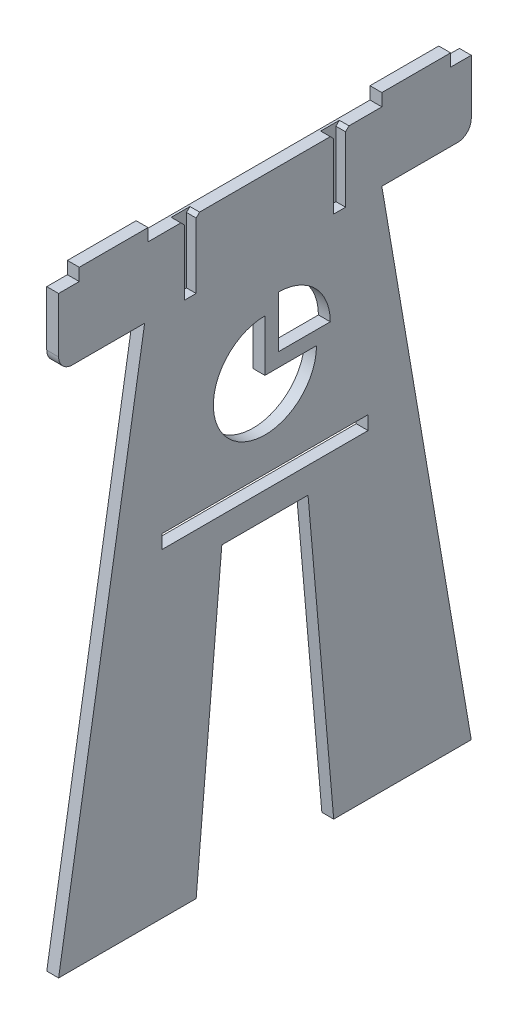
ISO-10303-21;
HEADER;
FILE_DESCRIPTION(('STEP AP214'),'2;1');
FILE_NAME('part.step','',(''),(''),'','','');
FILE_SCHEMA(('AUTOMOTIVE_DESIGN { 1 0 10303 214 1 1 1 1 }'));
ENDSEC;
DATA;
#1=APPLICATION_CONTEXT('core data for automotive mechanical design processes');
#2=APPLICATION_PROTOCOL_DEFINITION('international standard','automotive_design',2000,#1);
#3=PRODUCT_CONTEXT('',#1,'mechanical');
#4=PRODUCT('Part','Part','',(#3));
#5=PRODUCT_RELATED_PRODUCT_CATEGORY('part','',(#4));
#6=PRODUCT_DEFINITION_FORMATION('','',#4);
#7=PRODUCT_DEFINITION_CONTEXT('part definition',#1,'design');
#8=PRODUCT_DEFINITION('design','',#6,#7);
#9=PRODUCT_DEFINITION_SHAPE('','',#8);
#10=(LENGTH_UNIT() NAMED_UNIT(*) SI_UNIT(.MILLI.,.METRE.));
#11=(NAMED_UNIT(*) PLANE_ANGLE_UNIT() SI_UNIT($,.RADIAN.));
#12=(NAMED_UNIT(*) SI_UNIT($,.STERADIAN.) SOLID_ANGLE_UNIT());
#13=UNCERTAINTY_MEASURE_WITH_UNIT(LENGTH_MEASURE(1.E-05),#10,'distance_accuracy_value','');
#14=(GEOMETRIC_REPRESENTATION_CONTEXT(3) GLOBAL_UNCERTAINTY_ASSIGNED_CONTEXT((#13)) GLOBAL_UNIT_ASSIGNED_CONTEXT((#10,
#11,#12)) REPRESENTATION_CONTEXT('',''));
#15=CARTESIAN_POINT('',(0.,0.,0.));
#16=DIRECTION('',(0.,0.,1.));
#17=DIRECTION('',(1.,0.,0.));
#18=AXIS2_PLACEMENT_3D('',#15,#16,#17);
#19=CARTESIAN_POINT('',(17.25,-100.,80.3703703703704));
#20=DIRECTION('',(0.,0.,-1.));
#21=DIRECTION('',(-1.,0.,0.));
#22=AXIS2_PLACEMENT_3D('',#19,#20,#21);
#23=PLANE('',#22);
#24=DIRECTION('',(0.,-1.,0.));
#25=VECTOR('',#24,1.);
#26=CARTESIAN_POINT('',(0.,-100.,80.3703703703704));
#27=LINE('',#26,#25);
#28=CARTESIAN_POINT('',(0.,0.,80.3703703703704));
#29=VERTEX_POINT('',#28);
#30=CARTESIAN_POINT('',(0.,-80.,80.3703703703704));
#31=VERTEX_POINT('',#30);
#32=EDGE_CURVE('E440',#29,#31,#27,.T.);
#33=ORIENTED_EDGE('',*,*,#32,.T.);
#34=DIRECTION('',(-1.,0.,0.));
#35=VECTOR('',#34,1.);
#36=CARTESIAN_POINT('',(17.25,-80.,80.3703703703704));
#37=LINE('',#36,#35);
#38=CARTESIAN_POINT('',(17.25,-80.,80.3703703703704));
#39=VERTEX_POINT('',#38);
#40=EDGE_CURVE('E599',#31,#39,#37,.F.);
#41=ORIENTED_EDGE('',*,*,#40,.T.);
#42=DIRECTION('',(0.,-1.,0.));
#43=VECTOR('',#42,1.);
#44=CARTESIAN_POINT('',(17.25,-100.,80.3703703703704));
#45=LINE('',#44,#43);
#46=CARTESIAN_POINT('',(17.25,0.,80.3703703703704));
#47=VERTEX_POINT('',#46);
#48=EDGE_CURVE('E443',#47,#39,#45,.T.);
#49=ORIENTED_EDGE('',*,*,#48,.F.);
#50=DIRECTION('',(-1.,0.,0.));
#51=VECTOR('',#50,1.);
#52=CARTESIAN_POINT('',(17.25,0.,80.3703703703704));
#53=LINE('',#52,#51);
#54=EDGE_CURVE('E489',#47,#29,#53,.T.);
#55=ORIENTED_EDGE('',*,*,#54,.T.);
#56=EDGE_LOOP('',(#33,#41,#49,#55));
#57=FACE_BOUND('',#56,.T.);
#58=ADVANCED_FACE('F33',(#57),#23,.F.);
#59=CARTESIAN_POINT('',(17.25,-100.,80.3703703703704));
#60=DIRECTION('',(0.,1.,0.));
#61=DIRECTION('',(0.,0.,1.));
#62=AXIS2_PLACEMENT_3D('',#59,#60,#61);
#63=PLANE('',#62);
#64=DIRECTION('',(0.,0.,-1.));
#65=VECTOR('',#64,1.);
#66=CARTESIAN_POINT('',(17.25,-100.,80.3703703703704));
#67=LINE('',#66,#65);
#68=CARTESIAN_POINT('',(17.25,-100.,60.3703703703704));
#69=VERTEX_POINT('',#68);
#70=CARTESIAN_POINT('',(17.25,-100.,-44.7053872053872));
#71=VERTEX_POINT('',#70);
#72=EDGE_CURVE('E446',#69,#71,#67,.T.);
#73=ORIENTED_EDGE('',*,*,#72,.F.);
#74=DIRECTION('',(-1.,0.,0.));
#75=VECTOR('',#74,1.);
#76=CARTESIAN_POINT('',(17.25,-100.,60.3703703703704));
#77=LINE('',#76,#75);
#78=CARTESIAN_POINT('',(0.,-100.,60.3703703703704));
#79=VERTEX_POINT('',#78);
#80=EDGE_CURVE('E596',#69,#79,#77,.T.);
#81=ORIENTED_EDGE('',*,*,#80,.T.);
#82=DIRECTION('',(0.,0.,-1.));
#83=VECTOR('',#82,1.);
#84=CARTESIAN_POINT('',(0.,-100.,80.3703703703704));
#85=LINE('',#84,#83);
#86=CARTESIAN_POINT('',(0.,-100.,-44.7053872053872));
#87=VERTEX_POINT('',#86);
#88=EDGE_CURVE('E492',#79,#87,#85,.T.);
#89=ORIENTED_EDGE('',*,*,#88,.T.);
#90=DIRECTION('',(-1.,0.,0.));
#91=VECTOR('',#90,1.);
#92=CARTESIAN_POINT('',(17.25,-100.,-44.7053872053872));
#93=LINE('',#92,#91);
#94=EDGE_CURVE('E580',#71,#87,#93,.T.);
#95=ORIENTED_EDGE('',*,*,#94,.F.);
#96=EDGE_LOOP('',(#73,#81,#89,#95));
#97=FACE_BOUND('',#96,.T.);
#98=ADVANCED_FACE('F689',(#97),#63,.F.);
#99=CARTESIAN_POINT('',(17.25,-100.,-44.7053872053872));
#100=DIRECTION('',(0.,-0.161973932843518,-0.986795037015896));
#101=DIRECTION('',(0.,0.986795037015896,-0.161973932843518));
#102=AXIS2_PLACEMENT_3D('',#99,#100,#101);
#103=PLANE('',#102);
#104=DIRECTION('',(0.,-0.986795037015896,0.161973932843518));
#105=VECTOR('',#104,1.);
#106=CARTESIAN_POINT('',(0.,-100.,-44.7053872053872));
#107=LINE('',#106,#105);
#108=CARTESIAN_POINT('',(0.,-862.,80.3703703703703));
#109=VERTEX_POINT('',#108);
#110=EDGE_CURVE('E494',#87,#109,#107,.T.);
#111=ORIENTED_EDGE('',*,*,#110,.T.);
#112=DIRECTION('',(-1.,0.,0.));
#113=VECTOR('',#112,1.);
#114=CARTESIAN_POINT('',(17.25,-862.,80.3703703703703));
#115=LINE('',#114,#113);
#116=CARTESIAN_POINT('',(17.25,-862.,80.3703703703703));
#117=VERTEX_POINT('',#116);
#118=EDGE_CURVE('E577',#117,#109,#115,.T.);
#119=ORIENTED_EDGE('',*,*,#118,.F.);
#120=DIRECTION('',(0.,-0.986795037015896,0.161973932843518));
#121=VECTOR('',#120,1.);
#122=CARTESIAN_POINT('',(17.25,-100.,-44.7053872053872));
#123=LINE('',#122,#121);
#124=EDGE_CURVE('E449',#71,#117,#123,.T.);
#125=ORIENTED_EDGE('',*,*,#124,.F.);
#126=ORIENTED_EDGE('',*,*,#94,.T.);
#127=EDGE_LOOP('',(#111,#119,#125,#126));
#128=FACE_BOUND('',#127,.T.);
#129=ADVANCED_FACE('F698',(#128),#103,.F.);
#130=CARTESIAN_POINT('',(17.25,-862.,80.3703703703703));
#131=DIRECTION('',(0.,1.,0.));
#132=DIRECTION('',(0.,0.,1.));
#133=AXIS2_PLACEMENT_3D('',#130,#131,#132);
#134=PLANE('',#133);
#135=DIRECTION('',(0.,0.,-1.));
#136=VECTOR('',#135,1.);
#137=CARTESIAN_POINT('',(0.,-862.,80.3703703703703));
#138=LINE('',#137,#136);
#139=CARTESIAN_POINT('',(0.,-862.,-119.62962962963));
#140=VERTEX_POINT('',#139);
#141=EDGE_CURVE('E496',#109,#140,#138,.T.);
#142=ORIENTED_EDGE('',*,*,#141,.T.);
#143=DIRECTION('',(-1.,0.,0.));
#144=VECTOR('',#143,1.);
#145=CARTESIAN_POINT('',(17.25,-862.,-119.62962962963));
#146=LINE('',#145,#144);
#147=CARTESIAN_POINT('',(17.25,-862.,-119.62962962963));
#148=VERTEX_POINT('',#147);
#149=EDGE_CURVE('E574',#148,#140,#146,.T.);
#150=ORIENTED_EDGE('',*,*,#149,.F.);
#151=DIRECTION('',(0.,0.,-1.));
#152=VECTOR('',#151,1.);
#153=CARTESIAN_POINT('',(17.25,-862.,80.3703703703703));
#154=LINE('',#153,#152);
#155=EDGE_CURVE('E451',#117,#148,#154,.T.);
#156=ORIENTED_EDGE('',*,*,#155,.F.);
#157=ORIENTED_EDGE('',*,*,#118,.T.);
#158=EDGE_LOOP('',(#142,#150,#156,#157));
#159=FACE_BOUND('',#158,.T.);
#160=ADVANCED_FACE('F702',(#159),#134,.F.);
#161=CARTESIAN_POINT('',(17.25,-862.,-119.62962962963));
#162=DIRECTION('',(0.,0.0871557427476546,0.996194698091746));
#163=DIRECTION('',(0.,-0.996194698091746,0.0871557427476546));
#164=AXIS2_PLACEMENT_3D('',#161,#162,#163);
#165=PLANE('',#164);
#166=DIRECTION('',(0.,0.996194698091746,-0.0871557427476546));
#167=VECTOR('',#166,1.);
#168=CARTESIAN_POINT('',(0.,-862.,-119.62962962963));
#169=LINE('',#168,#167);
#170=CARTESIAN_POINT('',(0.,-435.290727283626,-156.961853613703));
#171=VERTEX_POINT('',#170);
#172=EDGE_CURVE('E498',#140,#171,#169,.T.);
#173=ORIENTED_EDGE('',*,*,#172,.T.);
#174=DIRECTION('',(-1.,0.,0.));
#175=VECTOR('',#174,1.);
#176=CARTESIAN_POINT('',(17.25,-435.290727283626,-156.961853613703));
#177=LINE('',#176,#175);
#178=CARTESIAN_POINT('',(17.25,-435.290727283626,-156.961853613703));
#179=VERTEX_POINT('',#178);
#180=EDGE_CURVE('E571',#179,#171,#177,.T.);
#181=ORIENTED_EDGE('',*,*,#180,.F.);
#182=DIRECTION('',(0.,0.996194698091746,-0.0871557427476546));
#183=VECTOR('',#182,1.);
#184=CARTESIAN_POINT('',(17.25,-862.,-119.62962962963));
#185=LINE('',#184,#183);
#186=EDGE_CURVE('E453',#148,#179,#185,.T.);
#187=ORIENTED_EDGE('',*,*,#186,.F.);
#188=ORIENTED_EDGE('',*,*,#149,.T.);
#189=EDGE_LOOP('',(#173,#181,#187,#188));
#190=FACE_BOUND('',#189,.T.);
#191=ADVANCED_FACE('F709',(#190),#165,.F.);
#192=CARTESIAN_POINT('',(17.25,-435.290727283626,-156.961853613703));
#193=DIRECTION('',(0.,1.,0.));
#194=DIRECTION('',(0.,0.,1.));
#195=AXIS2_PLACEMENT_3D('',#192,#193,#194);
#196=PLANE('',#195);
#197=DIRECTION('',(0.,0.,-1.));
#198=VECTOR('',#197,1.);
#199=CARTESIAN_POINT('',(0.,-435.290727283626,-156.961853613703));
#200=LINE('',#199,#198);
#201=CARTESIAN_POINT('',(0.,-435.290727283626,-282.297405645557));
#202=VERTEX_POINT('',#201);
#203=EDGE_CURVE('E500',#171,#202,#200,.T.);
#204=ORIENTED_EDGE('',*,*,#203,.T.);
#205=DIRECTION('',(-1.,0.,0.));
#206=VECTOR('',#205,1.);
#207=CARTESIAN_POINT('',(17.25,-435.290727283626,-282.297405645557));
#208=LINE('',#207,#206);
#209=CARTESIAN_POINT('',(17.25,-435.290727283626,-282.297405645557));
#210=VERTEX_POINT('',#209);
#211=EDGE_CURVE('E568',#210,#202,#208,.T.);
#212=ORIENTED_EDGE('',*,*,#211,.F.);
#213=DIRECTION('',(0.,0.,-1.));
#214=VECTOR('',#213,1.);
#215=CARTESIAN_POINT('',(17.25,-435.290727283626,-156.961853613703));
#216=LINE('',#215,#214);
#217=EDGE_CURVE('E455',#179,#210,#216,.T.);
#218=ORIENTED_EDGE('',*,*,#217,.F.);
#219=ORIENTED_EDGE('',*,*,#180,.T.);
#220=EDGE_LOOP('',(#204,#212,#218,#219));
#221=FACE_BOUND('',#220,.T.);
#222=ADVANCED_FACE('F712',(#221),#196,.F.);
#223=CARTESIAN_POINT('',(17.25,-435.290727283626,-282.297405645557));
#224=DIRECTION('',(0.,0.0871557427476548,-0.996194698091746));
#225=DIRECTION('',(0.,0.996194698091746,0.0871557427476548));
#226=AXIS2_PLACEMENT_3D('',#223,#224,#225);
#227=PLANE('',#226);
#228=DIRECTION('',(0.,-0.996194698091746,-0.0871557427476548));
#229=VECTOR('',#228,1.);
#230=CARTESIAN_POINT('',(0.,-435.290727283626,-282.297405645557));
#231=LINE('',#230,#229);
#232=CARTESIAN_POINT('',(0.,-862.,-319.62962962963));
#233=VERTEX_POINT('',#232);
#234=EDGE_CURVE('E502',#202,#233,#231,.T.);
#235=ORIENTED_EDGE('',*,*,#234,.T.);
#236=DIRECTION('',(-1.,0.,0.));
#237=VECTOR('',#236,1.);
#238=CARTESIAN_POINT('',(17.25,-862.,-319.62962962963));
#239=LINE('',#238,#237);
#240=CARTESIAN_POINT('',(17.25,-862.,-319.62962962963));
#241=VERTEX_POINT('',#240);
#242=EDGE_CURVE('E565',#241,#233,#239,.T.);
#243=ORIENTED_EDGE('',*,*,#242,.F.);
#244=DIRECTION('',(0.,-0.996194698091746,-0.0871557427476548));
#245=VECTOR('',#244,1.);
#246=CARTESIAN_POINT('',(17.25,-435.290727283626,-282.297405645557));
#247=LINE('',#246,#245);
#248=EDGE_CURVE('E457',#210,#241,#247,.T.);
#249=ORIENTED_EDGE('',*,*,#248,.F.);
#250=ORIENTED_EDGE('',*,*,#211,.T.);
#251=EDGE_LOOP('',(#235,#243,#249,#250));
#252=FACE_BOUND('',#251,.T.);
#253=ADVANCED_FACE('F717',(#252),#227,.F.);
#254=CARTESIAN_POINT('',(17.25,-862.,-319.62962962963));
#255=DIRECTION('',(0.,1.,0.));
#256=DIRECTION('',(0.,0.,1.));
#257=AXIS2_PLACEMENT_3D('',#254,#255,#256);
#258=PLANE('',#257);
#259=DIRECTION('',(0.,0.,-1.));
#260=VECTOR('',#259,1.);
#261=CARTESIAN_POINT('',(0.,-862.,-319.62962962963));
#262=LINE('',#261,#260);
#263=CARTESIAN_POINT('',(0.,-862.,-519.62962962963));
#264=VERTEX_POINT('',#263);
#265=EDGE_CURVE('E504',#233,#264,#262,.T.);
#266=ORIENTED_EDGE('',*,*,#265,.T.);
#267=DIRECTION('',(-1.,0.,0.));
#268=VECTOR('',#267,1.);
#269=CARTESIAN_POINT('',(17.25,-862.,-519.62962962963));
#270=LINE('',#269,#268);
#271=CARTESIAN_POINT('',(17.25,-862.,-519.62962962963));
#272=VERTEX_POINT('',#271);
#273=EDGE_CURVE('E562',#272,#264,#270,.T.);
#274=ORIENTED_EDGE('',*,*,#273,.F.);
#275=DIRECTION('',(0.,0.,-1.));
#276=VECTOR('',#275,1.);
#277=CARTESIAN_POINT('',(17.25,-862.,-319.62962962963));
#278=LINE('',#277,#276);
#279=EDGE_CURVE('E459',#241,#272,#278,.T.);
#280=ORIENTED_EDGE('',*,*,#279,.F.);
#281=ORIENTED_EDGE('',*,*,#242,.T.);
#282=EDGE_LOOP('',(#266,#274,#280,#281));
#283=FACE_BOUND('',#282,.T.);
#284=ADVANCED_FACE('F723',(#283),#258,.F.);
#285=CARTESIAN_POINT('',(17.25,-862.,-519.62962962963));
#286=DIRECTION('',(0.,-0.168173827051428,0.985757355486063));
#287=DIRECTION('',(0.,-0.985757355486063,-0.168173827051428));
#288=AXIS2_PLACEMENT_3D('',#285,#286,#287);
#289=PLANE('',#288);
#290=DIRECTION('',(0.,0.985757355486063,0.168173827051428));
#291=VECTOR('',#290,1.);
#292=CARTESIAN_POINT('',(0.,-862.,-519.62962962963));
#293=LINE('',#292,#291);
#294=CARTESIAN_POINT('',(0.,-99.9999999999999,-389.62962962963));
#295=VERTEX_POINT('',#294);
#296=EDGE_CURVE('E506',#264,#295,#293,.T.);
#297=ORIENTED_EDGE('',*,*,#296,.T.);
#298=DIRECTION('',(-1.,0.,0.));
#299=VECTOR('',#298,1.);
#300=CARTESIAN_POINT('',(17.25,-99.9999999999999,-389.62962962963));
#301=LINE('',#300,#299);
#302=CARTESIAN_POINT('',(17.25,-99.9999999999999,-389.62962962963));
#303=VERTEX_POINT('',#302);
#304=EDGE_CURVE('E559',#303,#295,#301,.T.);
#305=ORIENTED_EDGE('',*,*,#304,.F.);
#306=DIRECTION('',(0.,0.985757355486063,0.168173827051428));
#307=VECTOR('',#306,1.);
#308=CARTESIAN_POINT('',(17.25,-862.,-519.62962962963));
#309=LINE('',#308,#307);
#310=EDGE_CURVE('E461',#272,#303,#309,.T.);
#311=ORIENTED_EDGE('',*,*,#310,.F.);
#312=ORIENTED_EDGE('',*,*,#273,.T.);
#313=EDGE_LOOP('',(#297,#305,#311,#312));
#314=FACE_BOUND('',#313,.T.);
#315=ADVANCED_FACE('F727',(#314),#289,.F.);
#316=CARTESIAN_POINT('',(17.25,-99.9999999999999,-389.62962962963));
#317=DIRECTION('',(0.,1.,0.));
#318=DIRECTION('',(0.,0.,1.));
#319=AXIS2_PLACEMENT_3D('',#316,#317,#318);
#320=PLANE('',#319);
#321=DIRECTION('',(0.,0.,-1.));
#322=VECTOR('',#321,1.);
#323=CARTESIAN_POINT('',(0.,-99.9999999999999,-389.62962962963));
#324=LINE('',#323,#322);
#325=CARTESIAN_POINT('',(0.,-99.9999999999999,-499.62962962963));
#326=VERTEX_POINT('',#325);
#327=EDGE_CURVE('E508',#295,#326,#324,.T.);
#328=ORIENTED_EDGE('',*,*,#327,.T.);
#329=DIRECTION('',(-1.,0.,0.));
#330=VECTOR('',#329,1.);
#331=CARTESIAN_POINT('',(17.25,-99.9999999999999,-499.62962962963));
#332=LINE('',#331,#330);
#333=CARTESIAN_POINT('',(17.25,-99.9999999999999,-499.62962962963));
#334=VERTEX_POINT('',#333);
#335=EDGE_CURVE('E590',#326,#334,#332,.F.);
#336=ORIENTED_EDGE('',*,*,#335,.T.);
#337=DIRECTION('',(0.,0.,-1.));
#338=VECTOR('',#337,1.);
#339=CARTESIAN_POINT('',(17.25,-99.9999999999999,-389.62962962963));
#340=LINE('',#339,#338);
#341=EDGE_CURVE('E463',#303,#334,#340,.T.);
#342=ORIENTED_EDGE('',*,*,#341,.F.);
#343=ORIENTED_EDGE('',*,*,#304,.T.);
#344=EDGE_LOOP('',(#328,#336,#342,#343));
#345=FACE_BOUND('',#344,.T.);
#346=ADVANCED_FACE('F731',(#345),#320,.F.);
#347=CARTESIAN_POINT('',(17.25,0.,-519.62962962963));
#348=DIRECTION('',(0.,0.,1.));
#349=DIRECTION('',(1.,0.,0.));
#350=AXIS2_PLACEMENT_3D('',#347,#348,#349);
#351=PLANE('',#350);
#352=DIRECTION('',(0.,1.,0.));
#353=VECTOR('',#352,1.);
#354=CARTESIAN_POINT('',(17.25,0.,-519.62962962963));
#355=LINE('',#354,#353);
#356=CARTESIAN_POINT('',(17.25,-79.9999999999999,-519.62962962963));
#357=VERTEX_POINT('',#356);
#358=CARTESIAN_POINT('',(17.25,0.,-519.62962962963));
#359=VERTEX_POINT('',#358);
#360=EDGE_CURVE('E466',#357,#359,#355,.T.);
#361=ORIENTED_EDGE('',*,*,#360,.F.);
#362=DIRECTION('',(-1.,0.,0.));
#363=VECTOR('',#362,1.);
#364=CARTESIAN_POINT('',(17.25,-79.9999999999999,-519.62962962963));
#365=LINE('',#364,#363);
#366=CARTESIAN_POINT('',(0.,-79.9999999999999,-519.62962962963));
#367=VERTEX_POINT('',#366);
#368=EDGE_CURVE('E583',#357,#367,#365,.T.);
#369=ORIENTED_EDGE('',*,*,#368,.T.);
#370=DIRECTION('',(0.,1.,0.));
#371=VECTOR('',#370,1.);
#372=CARTESIAN_POINT('',(0.,0.,-519.62962962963));
#373=LINE('',#372,#371);
#374=CARTESIAN_POINT('',(0.,0.,-519.62962962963));
#375=VERTEX_POINT('',#374);
#376=EDGE_CURVE('E511',#367,#375,#373,.T.);
#377=ORIENTED_EDGE('',*,*,#376,.T.);
#378=DIRECTION('',(-1.,0.,0.));
#379=VECTOR('',#378,1.);
#380=CARTESIAN_POINT('',(17.25,0.,-519.62962962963));
#381=LINE('',#380,#379);
#382=EDGE_CURVE('E556',#359,#375,#381,.T.);
#383=ORIENTED_EDGE('',*,*,#382,.F.);
#384=EDGE_LOOP('',(#361,#369,#377,#383));
#385=FACE_BOUND('',#384,.T.);
#386=ADVANCED_FACE('F739',(#385),#351,.F.);
#387=CARTESIAN_POINT('',(17.25,0.,-489.62962962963));
#388=DIRECTION('',(0.,-1.,0.));
#389=DIRECTION('',(0.,0.,-1.));
#390=AXIS2_PLACEMENT_3D('',#387,#388,#389);
#391=PLANE('',#390);
#392=DIRECTION('',(0.,0.,1.));
#393=VECTOR('',#392,1.);
#394=CARTESIAN_POINT('',(0.,0.,-489.62962962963));
#395=LINE('',#394,#393);
#396=CARTESIAN_POINT('',(0.,0.,-489.62962962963));
#397=VERTEX_POINT('',#396);
#398=EDGE_CURVE('E513',#375,#397,#395,.T.);
#399=ORIENTED_EDGE('',*,*,#398,.T.);
#400=DIRECTION('',(-1.,0.,0.));
#401=VECTOR('',#400,1.);
#402=CARTESIAN_POINT('',(17.25,0.,-489.62962962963));
#403=LINE('',#402,#401);
#404=CARTESIAN_POINT('',(17.25,0.,-489.62962962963));
#405=VERTEX_POINT('',#404);
#406=EDGE_CURVE('E553',#405,#397,#403,.T.);
#407=ORIENTED_EDGE('',*,*,#406,.F.);
#408=DIRECTION('',(0.,0.,1.));
#409=VECTOR('',#408,1.);
#410=CARTESIAN_POINT('',(17.25,0.,-489.62962962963));
#411=LINE('',#410,#409);
#412=EDGE_CURVE('E468',#359,#405,#411,.T.);
#413=ORIENTED_EDGE('',*,*,#412,.F.);
#414=ORIENTED_EDGE('',*,*,#382,.T.);
#415=EDGE_LOOP('',(#399,#407,#413,#414));
#416=FACE_BOUND('',#415,.T.);
#417=ADVANCED_FACE('F746',(#416),#391,.F.);
#418=CARTESIAN_POINT('',(17.25,18.,-489.62962962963));
#419=DIRECTION('',(0.,0.,1.));
#420=DIRECTION('',(1.,0.,0.));
#421=AXIS2_PLACEMENT_3D('',#418,#419,#420);
#422=PLANE('',#421);
#423=DIRECTION('',(0.,1.,0.));
#424=VECTOR('',#423,1.);
#425=CARTESIAN_POINT('',(0.,18.,-489.62962962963));
#426=LINE('',#425,#424);
#427=CARTESIAN_POINT('',(0.,18.,-489.62962962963));
#428=VERTEX_POINT('',#427);
#429=EDGE_CURVE('E515',#397,#428,#426,.T.);
#430=ORIENTED_EDGE('',*,*,#429,.T.);
#431=DIRECTION('',(-1.,0.,0.));
#432=VECTOR('',#431,1.);
#433=CARTESIAN_POINT('',(17.25,18.,-489.62962962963));
#434=LINE('',#433,#432);
#435=CARTESIAN_POINT('',(17.25,18.,-489.62962962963));
#436=VERTEX_POINT('',#435);
#437=EDGE_CURVE('E550',#436,#428,#434,.T.);
#438=ORIENTED_EDGE('',*,*,#437,.F.);
#439=DIRECTION('',(0.,1.,0.));
#440=VECTOR('',#439,1.);
#441=CARTESIAN_POINT('',(17.25,18.,-489.62962962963));
#442=LINE('',#441,#440);
#443=EDGE_CURVE('E470',#405,#436,#442,.T.);
#444=ORIENTED_EDGE('',*,*,#443,.F.);
#445=ORIENTED_EDGE('',*,*,#406,.T.);
#446=EDGE_LOOP('',(#430,#438,#444,#445));
#447=FACE_BOUND('',#446,.T.);
#448=ADVANCED_FACE('F750',(#447),#422,.F.);
#449=CARTESIAN_POINT('',(17.25,18.,-389.62962962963));
#450=DIRECTION('',(0.,-1.,0.));
#451=DIRECTION('',(0.,0.,-1.));
#452=AXIS2_PLACEMENT_3D('',#449,#450,#451);
#453=PLANE('',#452);
#454=DIRECTION('',(0.,0.,1.));
#455=VECTOR('',#454,1.);
#456=CARTESIAN_POINT('',(0.,18.,-389.62962962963));
#457=LINE('',#456,#455);
#458=CARTESIAN_POINT('',(0.,18.,-389.62962962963));
#459=VERTEX_POINT('',#458);
#460=EDGE_CURVE('E517',#428,#459,#457,.T.);
#461=ORIENTED_EDGE('',*,*,#460,.T.);
#462=DIRECTION('',(-1.,0.,0.));
#463=VECTOR('',#462,1.);
#464=CARTESIAN_POINT('',(17.25,18.,-389.62962962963));
#465=LINE('',#464,#463);
#466=CARTESIAN_POINT('',(17.25,18.,-389.62962962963));
#467=VERTEX_POINT('',#466);
#468=EDGE_CURVE('E547',#467,#459,#465,.T.);
#469=ORIENTED_EDGE('',*,*,#468,.F.);
#470=DIRECTION('',(0.,0.,1.));
#471=VECTOR('',#470,1.);
#472=CARTESIAN_POINT('',(17.25,18.,-389.62962962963));
#473=LINE('',#472,#471);
#474=EDGE_CURVE('E472',#436,#467,#473,.T.);
#475=ORIENTED_EDGE('',*,*,#474,.F.);
#476=ORIENTED_EDGE('',*,*,#437,.T.);
#477=EDGE_LOOP('',(#461,#469,#475,#476));
#478=FACE_BOUND('',#477,.T.);
#479=ADVANCED_FACE('F757',(#478),#453,.F.);
#480=CARTESIAN_POINT('',(17.25,0.,-389.62962962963));
#481=DIRECTION('',(0.,0.,-1.));
#482=DIRECTION('',(-1.,0.,0.));
#483=AXIS2_PLACEMENT_3D('',#480,#481,#482);
#484=PLANE('',#483);
#485=DIRECTION('',(0.,-1.,0.));
#486=VECTOR('',#485,1.);
#487=CARTESIAN_POINT('',(0.,0.,-389.62962962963));
#488=LINE('',#487,#486);
#489=CARTESIAN_POINT('',(0.,0.,-389.62962962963));
#490=VERTEX_POINT('',#489);
#491=EDGE_CURVE('E519',#459,#490,#488,.T.);
#492=ORIENTED_EDGE('',*,*,#491,.T.);
#493=DIRECTION('',(-1.,0.,0.));
#494=VECTOR('',#493,1.);
#495=CARTESIAN_POINT('',(17.25,0.,-389.62962962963));
#496=LINE('',#495,#494);
#497=CARTESIAN_POINT('',(17.25,0.,-389.62962962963));
#498=VERTEX_POINT('',#497);
#499=EDGE_CURVE('E544',#498,#490,#496,.T.);
#500=ORIENTED_EDGE('',*,*,#499,.F.);
#501=DIRECTION('',(0.,-1.,0.));
#502=VECTOR('',#501,1.);
#503=CARTESIAN_POINT('',(17.25,0.,-389.62962962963));
#504=LINE('',#503,#502);
#505=EDGE_CURVE('E474',#467,#498,#504,.T.);
#506=ORIENTED_EDGE('',*,*,#505,.F.);
#507=ORIENTED_EDGE('',*,*,#468,.T.);
#508=EDGE_LOOP('',(#492,#500,#506,#507));
#509=FACE_BOUND('',#508,.T.);
#510=ADVANCED_FACE('F760',(#509),#484,.F.);
#511=CARTESIAN_POINT('',(17.25,0.,-49.6296296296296));
#512=DIRECTION('',(0.,-1.,0.));
#513=DIRECTION('',(0.,0.,-1.));
#514=AXIS2_PLACEMENT_3D('',#511,#512,#513);
#515=PLANE('',#514);
#516=DIRECTION('',(0.,0.,1.));
#517=VECTOR('',#516,1.);
#518=CARTESIAN_POINT('',(3.25,-1.62020784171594E-13,0.));
#519=LINE('',#518,#517);
#520=CARTESIAN_POINT('',(3.25,0.,-341.87962962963));
#521=VERTEX_POINT('',#520);
#522=CARTESIAN_POINT('',(3.25,0.,-314.62962962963));
#523=VERTEX_POINT('',#522);
#524=EDGE_CURVE('E406',#521,#523,#519,.T.);
#525=ORIENTED_EDGE('',*,*,#524,.F.);
#526=DIRECTION('',(1.,0.,0.));
#527=VECTOR('',#526,1.);
#528=CARTESIAN_POINT('',(17.25,0.,-341.87962962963));
#529=LINE('',#528,#527);
#530=CARTESIAN_POINT('',(17.25,0.,-341.87962962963));
#531=VERTEX_POINT('',#530);
#532=EDGE_CURVE('E610',#521,#531,#529,.T.);
#533=ORIENTED_EDGE('',*,*,#532,.T.);
#534=DIRECTION('',(0.,0.,1.));
#535=VECTOR('',#534,1.);
#536=CARTESIAN_POINT('',(17.25,0.,-49.6296296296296));
#537=LINE('',#536,#535);
#538=EDGE_CURVE('E477',#498,#531,#537,.T.);
#539=ORIENTED_EDGE('',*,*,#538,.F.);
#540=ORIENTED_EDGE('',*,*,#499,.T.);
#541=DIRECTION('',(0.,0.,1.));
#542=VECTOR('',#541,1.);
#543=CARTESIAN_POINT('',(0.,0.,-49.6296296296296));
#544=LINE('',#543,#542);
#545=CARTESIAN_POINT('',(0.,0.,-49.6296296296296));
#546=VERTEX_POINT('',#545);
#547=EDGE_CURVE('E521',#490,#546,#544,.T.);
#548=ORIENTED_EDGE('',*,*,#547,.T.);
#549=DIRECTION('',(-1.,0.,0.));
#550=VECTOR('',#549,1.);
#551=CARTESIAN_POINT('',(17.25,0.,-49.6296296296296));
#552=LINE('',#551,#550);
#553=CARTESIAN_POINT('',(17.25,0.,-49.6296296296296));
#554=VERTEX_POINT('',#553);
#555=EDGE_CURVE('E541',#554,#546,#552,.T.);
#556=ORIENTED_EDGE('',*,*,#555,.F.);
#557=CARTESIAN_POINT('',(17.25,0.,-97.3796296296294));
#558=VERTEX_POINT('',#557);
#559=EDGE_CURVE('E476',#558,#554,#537,.T.);
#560=ORIENTED_EDGE('',*,*,#559,.F.);
#561=DIRECTION('',(-1.,0.,0.));
#562=VECTOR('',#561,1.);
#563=CARTESIAN_POINT('',(17.25,0.,-97.3796296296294));
#564=LINE('',#563,#562);
#565=CARTESIAN_POINT('',(3.25,0.,-97.3796296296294));
#566=VERTEX_POINT('',#565);
#567=EDGE_CURVE('E601',#558,#566,#564,.T.);
#568=ORIENTED_EDGE('',*,*,#567,.T.);
#569=DIRECTION('',(0.,0.,1.));
#570=VECTOR('',#569,1.);
#571=CARTESIAN_POINT('',(3.25,-3.66897081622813E-13,0.));
#572=LINE('',#571,#570);
#573=CARTESIAN_POINT('',(3.25,0.,-124.62962962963));
#574=VERTEX_POINT('',#573);
#575=EDGE_CURVE('E429',#574,#566,#572,.T.);
#576=ORIENTED_EDGE('',*,*,#575,.F.);
#577=DIRECTION('',(1.,0.,0.));
#578=VECTOR('',#577,1.);
#579=CARTESIAN_POINT('',(17.25,0.,-124.62962962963));
#580=LINE('',#579,#578);
#581=CARTESIAN_POINT('',(17.25,0.,-124.62962962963));
#582=VERTEX_POINT('',#581);
#583=EDGE_CURVE('E604',#574,#582,#580,.T.);
#584=ORIENTED_EDGE('',*,*,#583,.T.);
#585=CARTESIAN_POINT('',(17.25,0.,-314.62962962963));
#586=VERTEX_POINT('',#585);
#587=EDGE_CURVE('E481',#586,#582,#537,.T.);
#588=ORIENTED_EDGE('',*,*,#587,.F.);
#589=DIRECTION('',(-1.,0.,0.));
#590=VECTOR('',#589,1.);
#591=CARTESIAN_POINT('',(17.25,0.,-314.62962962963));
#592=LINE('',#591,#590);
#593=EDGE_CURVE('E607',#586,#523,#592,.T.);
#594=ORIENTED_EDGE('',*,*,#593,.T.);
#595=EDGE_LOOP('',(#525,#533,#539,#540,#548,#556,#560,#568,#576,#584,#588,#594));
#596=FACE_BOUND('',#595,.T.);
#597=ADVANCED_FACE('F647',(#596),#515,.F.);
#598=CARTESIAN_POINT('',(17.25,18.,-49.6296296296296));
#599=DIRECTION('',(0.,0.,1.));
#600=DIRECTION('',(0.,-1.,0.));
#601=AXIS2_PLACEMENT_3D('',#598,#599,#600);
#602=PLANE('',#601);
#603=DIRECTION('',(0.,1.,0.));
#604=VECTOR('',#603,1.);
#605=CARTESIAN_POINT('',(0.,18.,-49.6296296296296));
#606=LINE('',#605,#604);
#607=CARTESIAN_POINT('',(0.,18.,-49.6296296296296));
#608=VERTEX_POINT('',#607);
#609=EDGE_CURVE('E523',#546,#608,#606,.T.);
#610=ORIENTED_EDGE('',*,*,#609,.T.);
#611=DIRECTION('',(-1.,0.,0.));
#612=VECTOR('',#611,1.);
#613=CARTESIAN_POINT('',(17.25,18.,-49.6296296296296));
#614=LINE('',#613,#612);
#615=CARTESIAN_POINT('',(17.25,18.,-49.6296296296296));
#616=VERTEX_POINT('',#615);
#617=EDGE_CURVE('E538',#616,#608,#614,.T.);
#618=ORIENTED_EDGE('',*,*,#617,.F.);
#619=DIRECTION('',(0.,1.,0.));
#620=VECTOR('',#619,1.);
#621=CARTESIAN_POINT('',(17.25,18.,-49.6296296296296));
#622=LINE('',#621,#620);
#623=EDGE_CURVE('E480',#554,#616,#622,.T.);
#624=ORIENTED_EDGE('',*,*,#623,.F.);
#625=ORIENTED_EDGE('',*,*,#555,.T.);
#626=EDGE_LOOP('',(#610,#618,#624,#625));
#627=FACE_BOUND('',#626,.T.);
#628=ADVANCED_FACE('F662',(#627),#602,.F.);
#629=CARTESIAN_POINT('',(17.25,18.,50.3703703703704));
#630=DIRECTION('',(0.,-1.,0.));
#631=DIRECTION('',(0.,0.,-1.));
#632=AXIS2_PLACEMENT_3D('',#629,#630,#631);
#633=PLANE('',#632);
#634=DIRECTION('',(0.,0.,1.));
#635=VECTOR('',#634,1.);
#636=CARTESIAN_POINT('',(0.,18.,50.3703703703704));
#637=LINE('',#636,#635);
#638=CARTESIAN_POINT('',(0.,18.,50.3703703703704));
#639=VERTEX_POINT('',#638);
#640=EDGE_CURVE('E525',#608,#639,#637,.T.);
#641=ORIENTED_EDGE('',*,*,#640,.T.);
#642=DIRECTION('',(-1.,0.,0.));
#643=VECTOR('',#642,1.);
#644=CARTESIAN_POINT('',(17.25,18.,50.3703703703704));
#645=LINE('',#644,#643);
#646=CARTESIAN_POINT('',(17.25,18.,50.3703703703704));
#647=VERTEX_POINT('',#646);
#648=EDGE_CURVE('E535',#647,#639,#645,.T.);
#649=ORIENTED_EDGE('',*,*,#648,.F.);
#650=DIRECTION('',(0.,0.,1.));
#651=VECTOR('',#650,1.);
#652=CARTESIAN_POINT('',(17.25,18.,50.3703703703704));
#653=LINE('',#652,#651);
#654=EDGE_CURVE('E483',#616,#647,#653,.T.);
#655=ORIENTED_EDGE('',*,*,#654,.F.);
#656=ORIENTED_EDGE('',*,*,#617,.T.);
#657=EDGE_LOOP('',(#641,#649,#655,#656));
#658=FACE_BOUND('',#657,.T.);
#659=ADVANCED_FACE('F667',(#658),#633,.F.);
#660=CARTESIAN_POINT('',(17.25,0.,50.3703703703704));
#661=DIRECTION('',(0.,0.,-1.));
#662=DIRECTION('',(-1.,0.,0.));
#663=AXIS2_PLACEMENT_3D('',#660,#661,#662);
#664=PLANE('',#663);
#665=DIRECTION('',(0.,-1.,0.));
#666=VECTOR('',#665,1.);
#667=CARTESIAN_POINT('',(0.,0.,50.3703703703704));
#668=LINE('',#667,#666);
#669=CARTESIAN_POINT('',(0.,0.,50.3703703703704));
#670=VERTEX_POINT('',#669);
#671=EDGE_CURVE('E527',#639,#670,#668,.T.);
#672=ORIENTED_EDGE('',*,*,#671,.T.);
#673=DIRECTION('',(-1.,0.,0.));
#674=VECTOR('',#673,1.);
#675=CARTESIAN_POINT('',(17.25,0.,50.3703703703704));
#676=LINE('',#675,#674);
#677=CARTESIAN_POINT('',(17.25,0.,50.3703703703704));
#678=VERTEX_POINT('',#677);
#679=EDGE_CURVE('E532',#678,#670,#676,.T.);
#680=ORIENTED_EDGE('',*,*,#679,.F.);
#681=DIRECTION('',(0.,-1.,0.));
#682=VECTOR('',#681,1.);
#683=CARTESIAN_POINT('',(17.25,0.,50.3703703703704));
#684=LINE('',#683,#682);
#685=EDGE_CURVE('E485',#647,#678,#684,.T.);
#686=ORIENTED_EDGE('',*,*,#685,.F.);
#687=ORIENTED_EDGE('',*,*,#648,.T.);
#688=EDGE_LOOP('',(#672,#680,#686,#687));
#689=FACE_BOUND('',#688,.T.);
#690=ADVANCED_FACE('F673',(#689),#664,.F.);
#691=CARTESIAN_POINT('',(17.25,0.,80.3703703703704));
#692=DIRECTION('',(0.,-1.,0.));
#693=DIRECTION('',(0.,0.,-1.));
#694=AXIS2_PLACEMENT_3D('',#691,#692,#693);
#695=PLANE('',#694);
#696=DIRECTION('',(0.,0.,1.));
#697=VECTOR('',#696,1.);
#698=CARTESIAN_POINT('',(0.,0.,80.3703703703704));
#699=LINE('',#698,#697);
#700=EDGE_CURVE('E447',#670,#29,#699,.T.);
#701=ORIENTED_EDGE('',*,*,#700,.T.);
#702=ORIENTED_EDGE('',*,*,#54,.F.);
#703=DIRECTION('',(0.,0.,1.));
#704=VECTOR('',#703,1.);
#705=CARTESIAN_POINT('',(17.25,0.,80.3703703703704));
#706=LINE('',#705,#704);
#707=EDGE_CURVE('E487',#678,#47,#706,.T.);
#708=ORIENTED_EDGE('',*,*,#707,.F.);
#709=ORIENTED_EDGE('',*,*,#679,.T.);
#710=EDGE_LOOP('',(#701,#702,#708,#709));
#711=FACE_BOUND('',#710,.T.);
#712=ADVANCED_FACE('F677',(#711),#695,.F.);
#713=CARTESIAN_POINT('',(17.25,0.,0.));
#714=DIRECTION('',(-1.,0.,0.));
#715=DIRECTION('',(0.,0.,1.));
#716=AXIS2_PLACEMENT_3D('',#713,#714,#715);
#717=PLANE('',#716);
#718=DIRECTION('',(0.,1.,0.));
#719=VECTOR('',#718,1.);
#720=CARTESIAN_POINT('',(17.25,0.,-369.62962962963));
#721=LINE('',#720,#719);
#722=CARTESIAN_POINT('',(17.25,-397.634531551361,-369.62962962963));
#723=VERTEX_POINT('',#722);
#724=CARTESIAN_POINT('',(17.25,-377.634531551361,-369.62962962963));
#725=VERTEX_POINT('',#724);
#726=EDGE_CURVE('E340',#723,#725,#721,.T.);
#727=ORIENTED_EDGE('',*,*,#726,.F.);
#728=DIRECTION('',(0.,0.,-1.));
#729=VECTOR('',#728,1.);
#730=CARTESIAN_POINT('',(17.25,-397.634531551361,0.));
#731=LINE('',#730,#729);
#732=CARTESIAN_POINT('',(17.25,-397.634531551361,-69.6296296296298));
#733=VERTEX_POINT('',#732);
#734=EDGE_CURVE('E48',#733,#723,#731,.T.);
#735=ORIENTED_EDGE('',*,*,#734,.F.);
#736=DIRECTION('',(0.,-1.,0.));
#737=VECTOR('',#736,1.);
#738=CARTESIAN_POINT('',(17.25,0.,-69.6296296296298));
#739=LINE('',#738,#737);
#740=CARTESIAN_POINT('',(17.25,-377.634531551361,-69.6296296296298));
#741=VERTEX_POINT('',#740);
#742=EDGE_CURVE('E331',#741,#733,#739,.T.);
#743=ORIENTED_EDGE('',*,*,#742,.F.);
#744=DIRECTION('',(0.,0.,1.));
#745=VECTOR('',#744,1.);
#746=CARTESIAN_POINT('',(17.25,-377.634531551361,0.));
#747=LINE('',#746,#745);
#748=EDGE_CURVE('E334',#725,#741,#747,.T.);
#749=ORIENTED_EDGE('',*,*,#748,.F.);
#750=EDGE_LOOP('',(#727,#735,#743,#749));
#751=FACE_BOUND('',#750,.T.);
#752=CARTESIAN_POINT('',(17.25,-233.175250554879,-239.629629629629));
#753=DIRECTION('',(-1.,0.,0.));
#754=DIRECTION('',(0.,0.,1.));
#755=AXIS2_PLACEMENT_3D('',#752,#753,#754);
#756=CIRCLE('',#755,75.);
#757=CARTESIAN_POINT('',(17.25,-158.175250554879,-239.629629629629));
#758=VERTEX_POINT('',#757);
#759=CARTESIAN_POINT('',(17.25,-233.175250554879,-314.629629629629));
#760=VERTEX_POINT('',#759);
#761=EDGE_CURVE('E361',#758,#760,#756,.T.);
#762=ORIENTED_EDGE('',*,*,#761,.T.);
#763=DIRECTION('',(0.,0.,-1.));
#764=VECTOR('',#763,1.);
#765=CARTESIAN_POINT('',(17.25,-233.175250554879,0.));
#766=LINE('',#765,#764);
#767=CARTESIAN_POINT('',(17.25,-233.175250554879,-239.629629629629));
#768=VERTEX_POINT('',#767);
#769=EDGE_CURVE('E346',#768,#760,#766,.T.);
#770=ORIENTED_EDGE('',*,*,#769,.F.);
#771=DIRECTION('',(0.,-1.,0.));
#772=VECTOR('',#771,1.);
#773=CARTESIAN_POINT('',(17.25,0.,-239.629629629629));
#774=LINE('',#773,#772);
#775=EDGE_CURVE('E354',#758,#768,#774,.T.);
#776=ORIENTED_EDGE('',*,*,#775,.F.);
#777=EDGE_LOOP('',(#762,#770,#776));
#778=FACE_BOUND('',#777,.T.);
#779=DIRECTION('',(0.,1.,0.));
#780=VECTOR('',#779,1.);
#781=CARTESIAN_POINT('',(17.25,8.94072196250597E-13,-219.629629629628));
#782=LINE('',#781,#780);
#783=CARTESIAN_POINT('',(17.25,-253.175250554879,-219.629629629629));
#784=VERTEX_POINT('',#783);
#785=CARTESIAN_POINT('',(17.25,-178.175250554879,-219.629629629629));
#786=VERTEX_POINT('',#785);
#787=EDGE_CURVE('E385',#784,#786,#782,.T.);
#788=ORIENTED_EDGE('',*,*,#787,.F.);
#789=DIRECTION('',(0.,0.,1.));
#790=VECTOR('',#789,1.);
#791=CARTESIAN_POINT('',(17.25,-253.175250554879,0.));
#792=LINE('',#791,#790);
#793=CARTESIAN_POINT('',(17.25,-253.175250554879,-294.629629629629));
#794=VERTEX_POINT('',#793);
#795=EDGE_CURVE('E368',#794,#784,#792,.T.);
#796=ORIENTED_EDGE('',*,*,#795,.F.);
#797=CARTESIAN_POINT('',(17.25,-253.175250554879,-219.629629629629));
#798=DIRECTION('',(-1.,0.,0.));
#799=DIRECTION('',(0.,0.,1.));
#800=AXIS2_PLACEMENT_3D('',#797,#798,#799);
#801=CIRCLE('',#800,75.);
#802=EDGE_CURVE('E377',#794,#786,#801,.T.);
#803=ORIENTED_EDGE('',*,*,#802,.T.);
#804=EDGE_LOOP('',(#788,#796,#803));
#805=FACE_BOUND('',#804,.T.);
#806=ORIENTED_EDGE('',*,*,#538,.T.);
#807=DIRECTION('',(0.,0.707106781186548,-0.707106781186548));
#808=VECTOR('',#807,1.);
#809=CARTESIAN_POINT('',(17.25,0.,-341.87962962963));
#810=LINE('',#809,#808);
#811=CARTESIAN_POINT('',(17.25,-5.,-336.87962962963));
#812=VERTEX_POINT('',#811);
#813=EDGE_CURVE('E619',#531,#812,#810,.F.);
#814=ORIENTED_EDGE('',*,*,#813,.T.);
#815=DIRECTION('',(0.,1.,0.));
#816=VECTOR('',#815,1.);
#817=CARTESIAN_POINT('',(17.25,0.,-336.87962962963));
#818=LINE('',#817,#816);
#819=CARTESIAN_POINT('',(17.25,-100.,-336.87962962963));
#820=VERTEX_POINT('',#819);
#821=EDGE_CURVE('E400',#820,#812,#818,.T.);
#822=ORIENTED_EDGE('',*,*,#821,.F.);
#823=DIRECTION('',(0.,0.,-1.));
#824=VECTOR('',#823,1.);
#825=CARTESIAN_POINT('',(17.25,-100.,0.));
#826=LINE('',#825,#824);
#827=CARTESIAN_POINT('',(17.25,-100.,-319.62962962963));
#828=VERTEX_POINT('',#827);
#829=EDGE_CURVE('E410',#828,#820,#826,.T.);
#830=ORIENTED_EDGE('',*,*,#829,.F.);
#831=DIRECTION('',(0.,-1.,0.));
#832=VECTOR('',#831,1.);
#833=CARTESIAN_POINT('',(17.25,0.,-319.62962962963));
#834=LINE('',#833,#832);
#835=CARTESIAN_POINT('',(17.25,-5.,-319.62962962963));
#836=VERTEX_POINT('',#835);
#837=EDGE_CURVE('E392',#836,#828,#834,.T.);
#838=ORIENTED_EDGE('',*,*,#837,.F.);
#839=DIRECTION('',(0.,-0.707106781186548,-0.707106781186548));
#840=VECTOR('',#839,1.);
#841=CARTESIAN_POINT('',(17.25,-5.,-319.62962962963));
#842=LINE('',#841,#840);
#843=EDGE_CURVE('E617',#836,#586,#842,.F.);
#844=ORIENTED_EDGE('',*,*,#843,.T.);
#845=ORIENTED_EDGE('',*,*,#587,.T.);
#846=DIRECTION('',(0.,0.707106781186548,-0.707106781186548));
#847=VECTOR('',#846,1.);
#848=CARTESIAN_POINT('',(17.25,0.,-124.62962962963));
#849=LINE('',#848,#847);
#850=CARTESIAN_POINT('',(17.25,-5.,-119.62962962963));
#851=VERTEX_POINT('',#850);
#852=EDGE_CURVE('E615',#582,#851,#849,.F.);
#853=ORIENTED_EDGE('',*,*,#852,.T.);
#854=DIRECTION('',(0.,1.,0.));
#855=VECTOR('',#854,1.);
#856=CARTESIAN_POINT('',(17.25,0.,-119.62962962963));
#857=LINE('',#856,#855);
#858=CARTESIAN_POINT('',(17.25,-100.,-119.62962962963));
#859=VERTEX_POINT('',#858);
#860=EDGE_CURVE('E423',#859,#851,#857,.T.);
#861=ORIENTED_EDGE('',*,*,#860,.F.);
#862=DIRECTION('',(0.,0.,-1.));
#863=VECTOR('',#862,1.);
#864=CARTESIAN_POINT('',(17.25,-100.,-3.2180377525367E-13));
#865=LINE('',#864,#863);
#866=CARTESIAN_POINT('',(17.25,-100.,-102.37962962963));
#867=VERTEX_POINT('',#866);
#868=EDGE_CURVE('E433',#867,#859,#865,.T.);
#869=ORIENTED_EDGE('',*,*,#868,.F.);
#870=DIRECTION('',(0.,-1.,0.));
#871=VECTOR('',#870,1.);
#872=CARTESIAN_POINT('',(17.25,0.,-102.37962962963));
#873=LINE('',#872,#871);
#874=CARTESIAN_POINT('',(17.25,-5.00000000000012,-102.37962962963));
#875=VERTEX_POINT('',#874);
#876=EDGE_CURVE('E417',#875,#867,#873,.T.);
#877=ORIENTED_EDGE('',*,*,#876,.F.);
#878=DIRECTION('',(0.,-0.70710678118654,-0.707106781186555));
#879=VECTOR('',#878,1.);
#880=CARTESIAN_POINT('',(17.25,-5.00000000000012,-102.37962962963));
#881=LINE('',#880,#879);
#882=EDGE_CURVE('E613',#875,#558,#881,.F.);
#883=ORIENTED_EDGE('',*,*,#882,.T.);
#884=ORIENTED_EDGE('',*,*,#559,.T.);
#885=ORIENTED_EDGE('',*,*,#623,.T.);
#886=ORIENTED_EDGE('',*,*,#654,.T.);
#887=ORIENTED_EDGE('',*,*,#685,.T.);
#888=ORIENTED_EDGE('',*,*,#707,.T.);
#889=ORIENTED_EDGE('',*,*,#48,.T.);
#890=CARTESIAN_POINT('',(17.25,-80.,60.3703703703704));
#891=DIRECTION('',(-1.,0.,0.));
#892=DIRECTION('',(0.,0.,1.));
#893=AXIS2_PLACEMENT_3D('',#890,#891,#892);
#894=CIRCLE('',#893,20.);
#895=EDGE_CURVE('E592',#39,#69,#894,.F.);
#896=ORIENTED_EDGE('',*,*,#895,.T.);
#897=ORIENTED_EDGE('',*,*,#72,.T.);
#898=ORIENTED_EDGE('',*,*,#124,.T.);
#899=ORIENTED_EDGE('',*,*,#155,.T.);
#900=ORIENTED_EDGE('',*,*,#186,.T.);
#901=ORIENTED_EDGE('',*,*,#217,.T.);
#902=ORIENTED_EDGE('',*,*,#248,.T.);
#903=ORIENTED_EDGE('',*,*,#279,.T.);
#904=ORIENTED_EDGE('',*,*,#310,.T.);
#905=ORIENTED_EDGE('',*,*,#341,.T.);
#906=CARTESIAN_POINT('',(17.25,-79.9999999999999,-499.62962962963));
#907=DIRECTION('',(-1.,0.,0.));
#908=DIRECTION('',(0.,0.,1.));
#909=AXIS2_PLACEMENT_3D('',#906,#907,#908);
#910=CIRCLE('',#909,20.);
#911=EDGE_CURVE('E594',#334,#357,#910,.F.);
#912=ORIENTED_EDGE('',*,*,#911,.T.);
#913=ORIENTED_EDGE('',*,*,#360,.T.);
#914=ORIENTED_EDGE('',*,*,#412,.T.);
#915=ORIENTED_EDGE('',*,*,#443,.T.);
#916=ORIENTED_EDGE('',*,*,#474,.T.);
#917=ORIENTED_EDGE('',*,*,#505,.T.);
#918=EDGE_LOOP('',(#806,#814,#822,#830,#838,#844,#845,#853,#861,#869,#877,#883,#884,#885,#886,
#887,#888,#889,#896,#897,#898,#899,#900,#901,#902,#903,#904,#905,#912,#913,#914,#915,#916,#917));
#919=FACE_BOUND('',#918,.T.);
#920=ADVANCED_FACE('F650',(#751,#778,#805,#919),#717,.F.);
#921=CARTESIAN_POINT('',(0.,0.,0.));
#922=DIRECTION('',(-1.,0.,0.));
#923=DIRECTION('',(0.,0.,1.));
#924=AXIS2_PLACEMENT_3D('',#921,#922,#923);
#925=PLANE('',#924);
#926=DIRECTION('',(0.,0.,-1.));
#927=VECTOR('',#926,1.);
#928=CARTESIAN_POINT('',(0.,-397.634531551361,0.));
#929=LINE('',#928,#927);
#930=CARTESIAN_POINT('',(0.,-397.634531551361,-69.6296296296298));
#931=VERTEX_POINT('',#930);
#932=CARTESIAN_POINT('',(0.,-397.634531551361,-369.62962962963));
#933=VERTEX_POINT('',#932);
#934=EDGE_CURVE('E315',#931,#933,#929,.T.);
#935=ORIENTED_EDGE('',*,*,#934,.T.);
#936=DIRECTION('',(0.,1.,0.));
#937=VECTOR('',#936,1.);
#938=CARTESIAN_POINT('',(0.,0.,-369.62962962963));
#939=LINE('',#938,#937);
#940=CARTESIAN_POINT('',(0.,-377.634531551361,-369.62962962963));
#941=VERTEX_POINT('',#940);
#942=EDGE_CURVE('E324',#933,#941,#939,.T.);
#943=ORIENTED_EDGE('',*,*,#942,.T.);
#944=DIRECTION('',(0.,0.,1.));
#945=VECTOR('',#944,1.);
#946=CARTESIAN_POINT('',(0.,-377.634531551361,0.));
#947=LINE('',#946,#945);
#948=CARTESIAN_POINT('',(0.,-377.634531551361,-69.6296296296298));
#949=VERTEX_POINT('',#948);
#950=EDGE_CURVE('E56',#941,#949,#947,.T.);
#951=ORIENTED_EDGE('',*,*,#950,.T.);
#952=DIRECTION('',(0.,-1.,0.));
#953=VECTOR('',#952,1.);
#954=CARTESIAN_POINT('',(0.,0.,-69.6296296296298));
#955=LINE('',#954,#953);
#956=EDGE_CURVE('E321',#949,#931,#955,.T.);
#957=ORIENTED_EDGE('',*,*,#956,.T.);
#958=EDGE_LOOP('',(#935,#943,#951,#957));
#959=FACE_BOUND('',#958,.T.);
#960=DIRECTION('',(0.,0.,-1.));
#961=VECTOR('',#960,1.);
#962=CARTESIAN_POINT('',(0.,-233.175250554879,0.));
#963=LINE('',#962,#961);
#964=CARTESIAN_POINT('',(0.,-233.175250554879,-239.629629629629));
#965=VERTEX_POINT('',#964);
#966=CARTESIAN_POINT('',(0.,-233.175250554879,-314.629629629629));
#967=VERTEX_POINT('',#966);
#968=EDGE_CURVE('E350',#965,#967,#963,.T.);
#969=ORIENTED_EDGE('',*,*,#968,.T.);
#970=CARTESIAN_POINT('',(0.,-233.175250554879,-239.629629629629));
#971=DIRECTION('',(-1.,0.,0.));
#972=DIRECTION('',(0.,0.,1.));
#973=AXIS2_PLACEMENT_3D('',#970,#971,#972);
#974=CIRCLE('',#973,75.);
#975=CARTESIAN_POINT('',(0.,-158.175250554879,-239.629629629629));
#976=VERTEX_POINT('',#975);
#977=EDGE_CURVE('E353',#976,#967,#974,.T.);
#978=ORIENTED_EDGE('',*,*,#977,.F.);
#979=DIRECTION('',(0.,-1.,0.));
#980=VECTOR('',#979,1.);
#981=CARTESIAN_POINT('',(0.,0.,-239.629629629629));
#982=LINE('',#981,#980);
#983=EDGE_CURVE('E356',#976,#965,#982,.T.);
#984=ORIENTED_EDGE('',*,*,#983,.T.);
#985=EDGE_LOOP('',(#969,#978,#984));
#986=FACE_BOUND('',#985,.T.);
#987=DIRECTION('',(0.,0.,1.));
#988=VECTOR('',#987,1.);
#989=CARTESIAN_POINT('',(0.,-253.175250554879,0.));
#990=LINE('',#989,#988);
#991=CARTESIAN_POINT('',(0.,-253.175250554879,-294.629629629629));
#992=VERTEX_POINT('',#991);
#993=CARTESIAN_POINT('',(0.,-253.175250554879,-219.629629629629));
#994=VERTEX_POINT('',#993);
#995=EDGE_CURVE('E373',#992,#994,#990,.T.);
#996=ORIENTED_EDGE('',*,*,#995,.T.);
#997=DIRECTION('',(0.,1.,0.));
#998=VECTOR('',#997,1.);
#999=CARTESIAN_POINT('',(0.,8.94072196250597E-13,-219.629629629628));
#1000=LINE('',#999,#998);
#1001=CARTESIAN_POINT('',(0.,-178.175250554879,-219.629629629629));
#1002=VERTEX_POINT('',#1001);
#1003=EDGE_CURVE('E376',#994,#1002,#1000,.T.);
#1004=ORIENTED_EDGE('',*,*,#1003,.T.);
#1005=CARTESIAN_POINT('',(0.,-253.175250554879,-219.629629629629));
#1006=DIRECTION('',(-1.,0.,0.));
#1007=DIRECTION('',(0.,0.,1.));
#1008=AXIS2_PLACEMENT_3D('',#1005,#1006,#1007);
#1009=CIRCLE('',#1008,75.);
#1010=EDGE_CURVE('E380',#992,#1002,#1009,.T.);
#1011=ORIENTED_EDGE('',*,*,#1010,.F.);
#1012=EDGE_LOOP('',(#996,#1004,#1011));
#1013=FACE_BOUND('',#1012,.T.);
#1014=ORIENTED_EDGE('',*,*,#376,.F.);
#1015=CARTESIAN_POINT('',(0.,-79.9999999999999,-499.62962962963));
#1016=DIRECTION('',(-1.,0.,0.));
#1017=DIRECTION('',(0.,0.,1.));
#1018=AXIS2_PLACEMENT_3D('',#1015,#1016,#1017);
#1019=CIRCLE('',#1018,20.);
#1020=EDGE_CURVE('E588',#367,#326,#1019,.T.);
#1021=ORIENTED_EDGE('',*,*,#1020,.T.);
#1022=ORIENTED_EDGE('',*,*,#327,.F.);
#1023=ORIENTED_EDGE('',*,*,#296,.F.);
#1024=ORIENTED_EDGE('',*,*,#265,.F.);
#1025=ORIENTED_EDGE('',*,*,#234,.F.);
#1026=ORIENTED_EDGE('',*,*,#203,.F.);
#1027=ORIENTED_EDGE('',*,*,#172,.F.);
#1028=ORIENTED_EDGE('',*,*,#141,.F.);
#1029=ORIENTED_EDGE('',*,*,#110,.F.);
#1030=ORIENTED_EDGE('',*,*,#88,.F.);
#1031=CARTESIAN_POINT('',(0.,-80.,60.3703703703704));
#1032=DIRECTION('',(-1.,0.,0.));
#1033=DIRECTION('',(0.,0.,1.));
#1034=AXIS2_PLACEMENT_3D('',#1031,#1032,#1033);
#1035=CIRCLE('',#1034,20.);
#1036=EDGE_CURVE('E586',#79,#31,#1035,.T.);
#1037=ORIENTED_EDGE('',*,*,#1036,.T.);
#1038=ORIENTED_EDGE('',*,*,#32,.F.);
#1039=ORIENTED_EDGE('',*,*,#700,.F.);
#1040=ORIENTED_EDGE('',*,*,#671,.F.);
#1041=ORIENTED_EDGE('',*,*,#640,.F.);
#1042=ORIENTED_EDGE('',*,*,#609,.F.);
#1043=ORIENTED_EDGE('',*,*,#547,.F.);
#1044=ORIENTED_EDGE('',*,*,#491,.F.);
#1045=ORIENTED_EDGE('',*,*,#460,.F.);
#1046=ORIENTED_EDGE('',*,*,#429,.F.);
#1047=ORIENTED_EDGE('',*,*,#398,.F.);
#1048=EDGE_LOOP('',(#1014,#1021,#1022,#1023,#1024,#1025,#1026,#1027,#1028,#1029,#1030,#1037,
#1038,#1039,#1040,#1041,#1042,#1043,#1044,#1045,#1046,#1047));
#1049=FACE_BOUND('',#1048,.T.);
#1050=ADVANCED_FACE('F328',(#959,#986,#1013,#1049),#925,.T.);
#1051=CARTESIAN_POINT('',(3.25,0.,-102.37962962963));
#1052=DIRECTION('',(0.,0.,1.));
#1053=DIRECTION('',(0.,-1.,0.));
#1054=AXIS2_PLACEMENT_3D('',#1051,#1052,#1053);
#1055=PLANE('',#1054);
#1056=DIRECTION('',(0.,-1.,0.));
#1057=VECTOR('',#1056,1.);
#1058=CARTESIAN_POINT('',(3.25,0.,-102.37962962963));
#1059=LINE('',#1058,#1057);
#1060=CARTESIAN_POINT('',(3.25,-5.00000000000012,-102.37962962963));
#1061=VERTEX_POINT('',#1060);
#1062=CARTESIAN_POINT('',(3.25,-100.,-102.37962962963));
#1063=VERTEX_POINT('',#1062);
#1064=EDGE_CURVE('E420',#1061,#1063,#1059,.T.);
#1065=ORIENTED_EDGE('',*,*,#1064,.F.);
#1066=DIRECTION('',(1.,0.,0.));
#1067=VECTOR('',#1066,1.);
#1068=CARTESIAN_POINT('',(3.25,-5.00000000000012,-102.37962962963));
#1069=LINE('',#1068,#1067);
#1070=EDGE_CURVE('E628',#1061,#875,#1069,.T.);
#1071=ORIENTED_EDGE('',*,*,#1070,.T.);
#1072=ORIENTED_EDGE('',*,*,#876,.T.);
#1073=DIRECTION('',(1.,0.,0.));
#1074=VECTOR('',#1073,1.);
#1075=CARTESIAN_POINT('',(3.25,-100.,-102.37962962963));
#1076=LINE('',#1075,#1074);
#1077=EDGE_CURVE('E431',#1063,#867,#1076,.T.);
#1078=ORIENTED_EDGE('',*,*,#1077,.F.);
#1079=EDGE_LOOP('',(#1065,#1071,#1072,#1078));
#1080=FACE_BOUND('',#1079,.T.);
#1081=ADVANCED_FACE('F917',(#1080),#1055,.F.);
#1082=CARTESIAN_POINT('',(3.25,0.,-119.62962962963));
#1083=DIRECTION('',(0.,0.,-1.));
#1084=DIRECTION('',(0.,1.,0.));
#1085=AXIS2_PLACEMENT_3D('',#1082,#1083,#1084);
#1086=PLANE('',#1085);
#1087=ORIENTED_EDGE('',*,*,#860,.T.);
#1088=DIRECTION('',(-1.,0.,0.));
#1089=VECTOR('',#1088,1.);
#1090=CARTESIAN_POINT('',(3.25,-5.,-119.62962962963));
#1091=LINE('',#1090,#1089);
#1092=CARTESIAN_POINT('',(3.25,-5.,-119.62962962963));
#1093=VERTEX_POINT('',#1092);
#1094=EDGE_CURVE('E626',#851,#1093,#1091,.T.);
#1095=ORIENTED_EDGE('',*,*,#1094,.T.);
#1096=DIRECTION('',(0.,1.,0.));
#1097=VECTOR('',#1096,1.);
#1098=CARTESIAN_POINT('',(3.25,0.,-119.62962962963));
#1099=LINE('',#1098,#1097);
#1100=CARTESIAN_POINT('',(3.25,-100.,-119.62962962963));
#1101=VERTEX_POINT('',#1100);
#1102=EDGE_CURVE('E426',#1101,#1093,#1099,.T.);
#1103=ORIENTED_EDGE('',*,*,#1102,.F.);
#1104=DIRECTION('',(1.,0.,0.));
#1105=VECTOR('',#1104,1.);
#1106=CARTESIAN_POINT('',(3.25,-100.,-119.62962962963));
#1107=LINE('',#1106,#1105);
#1108=EDGE_CURVE('E438',#1101,#859,#1107,.T.);
#1109=ORIENTED_EDGE('',*,*,#1108,.T.);
#1110=EDGE_LOOP('',(#1087,#1095,#1103,#1109));
#1111=FACE_BOUND('',#1110,.T.);
#1112=ADVANCED_FACE('F967',(#1111),#1086,.F.);
#1113=CARTESIAN_POINT('',(3.25,-100.,-3.2180377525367E-13));
#1114=DIRECTION('',(0.,-1.,0.));
#1115=DIRECTION('',(0.,0.,-1.));
#1116=AXIS2_PLACEMENT_3D('',#1113,#1114,#1115);
#1117=PLANE('',#1116);
#1118=ORIENTED_EDGE('',*,*,#868,.T.);
#1119=ORIENTED_EDGE('',*,*,#1108,.F.);
#1120=DIRECTION('',(0.,0.,-1.));
#1121=VECTOR('',#1120,1.);
#1122=CARTESIAN_POINT('',(3.25,-100.,-3.2180377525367E-13));
#1123=LINE('',#1122,#1121);
#1124=EDGE_CURVE('E422',#1063,#1101,#1123,.T.);
#1125=ORIENTED_EDGE('',*,*,#1124,.F.);
#1126=ORIENTED_EDGE('',*,*,#1077,.T.);
#1127=EDGE_LOOP('',(#1118,#1119,#1125,#1126));
#1128=FACE_BOUND('',#1127,.T.);
#1129=ADVANCED_FACE('F966',(#1128),#1117,.F.);
#1130=CARTESIAN_POINT('',(3.25,0.,0.));
#1131=DIRECTION('',(1.,0.,0.));
#1132=DIRECTION('',(0.,0.,-1.));
#1133=AXIS2_PLACEMENT_3D('',#1130,#1131,#1132);
#1134=PLANE('',#1133);
#1135=ORIENTED_EDGE('',*,*,#575,.T.);
#1136=DIRECTION('',(0.,0.70710678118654,0.707106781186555));
#1137=VECTOR('',#1136,1.);
#1138=CARTESIAN_POINT('',(3.25,-5.00000000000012,-102.37962962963));
#1139=LINE('',#1138,#1137);
#1140=EDGE_CURVE('E11',#566,#1061,#1139,.F.);
#1141=ORIENTED_EDGE('',*,*,#1140,.T.);
#1142=ORIENTED_EDGE('',*,*,#1064,.T.);
#1143=ORIENTED_EDGE('',*,*,#1124,.T.);
#1144=ORIENTED_EDGE('',*,*,#1102,.T.);
#1145=DIRECTION('',(0.,-0.707106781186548,0.707106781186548));
#1146=VECTOR('',#1145,1.);
#1147=CARTESIAN_POINT('',(3.25,0.,-124.62962962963));
#1148=LINE('',#1147,#1146);
#1149=EDGE_CURVE('E41',#1093,#574,#1148,.F.);
#1150=ORIENTED_EDGE('',*,*,#1149,.T.);
#1151=EDGE_LOOP('',(#1135,#1141,#1142,#1143,#1144,#1150));
#1152=FACE_BOUND('',#1151,.T.);
#1153=ADVANCED_FACE('F639',(#1152),#1134,.T.);
#1154=CARTESIAN_POINT('',(3.25,0.,-319.62962962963));
#1155=DIRECTION('',(0.,0.,1.));
#1156=DIRECTION('',(1.,0.,0.));
#1157=AXIS2_PLACEMENT_3D('',#1154,#1155,#1156);
#1158=PLANE('',#1157);
#1159=DIRECTION('',(0.,-1.,0.));
#1160=VECTOR('',#1159,1.);
#1161=CARTESIAN_POINT('',(3.25,0.,-319.62962962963));
#1162=LINE('',#1161,#1160);
#1163=CARTESIAN_POINT('',(3.25,-5.,-319.62962962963));
#1164=VERTEX_POINT('',#1163);
#1165=CARTESIAN_POINT('',(3.25,-100.,-319.62962962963));
#1166=VERTEX_POINT('',#1165);
#1167=EDGE_CURVE('E397',#1164,#1166,#1162,.T.);
#1168=ORIENTED_EDGE('',*,*,#1167,.F.);
#1169=DIRECTION('',(1.,0.,0.));
#1170=VECTOR('',#1169,1.);
#1171=CARTESIAN_POINT('',(3.25,-5.,-319.62962962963));
#1172=LINE('',#1171,#1170);
#1173=EDGE_CURVE('E623',#1164,#836,#1172,.T.);
#1174=ORIENTED_EDGE('',*,*,#1173,.T.);
#1175=ORIENTED_EDGE('',*,*,#837,.T.);
#1176=DIRECTION('',(1.,0.,0.));
#1177=VECTOR('',#1176,1.);
#1178=CARTESIAN_POINT('',(3.25,-100.,-319.62962962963));
#1179=LINE('',#1178,#1177);
#1180=EDGE_CURVE('E408',#1166,#828,#1179,.T.);
#1181=ORIENTED_EDGE('',*,*,#1180,.F.);
#1182=EDGE_LOOP('',(#1168,#1174,#1175,#1181));
#1183=FACE_BOUND('',#1182,.T.);
#1184=ADVANCED_FACE('F780',(#1183),#1158,.F.);
#1185=CARTESIAN_POINT('',(3.25,0.,-336.87962962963));
#1186=DIRECTION('',(0.,0.,-1.));
#1187=DIRECTION('',(-1.,0.,0.));
#1188=AXIS2_PLACEMENT_3D('',#1185,#1186,#1187);
#1189=PLANE('',#1188);
#1190=ORIENTED_EDGE('',*,*,#821,.T.);
#1191=DIRECTION('',(-1.,0.,0.));
#1192=VECTOR('',#1191,1.);
#1193=CARTESIAN_POINT('',(3.25,-5.,-336.87962962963));
#1194=LINE('',#1193,#1192);
#1195=CARTESIAN_POINT('',(3.25,-5.,-336.87962962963));
#1196=VERTEX_POINT('',#1195);
#1197=EDGE_CURVE('E621',#812,#1196,#1194,.T.);
#1198=ORIENTED_EDGE('',*,*,#1197,.T.);
#1199=DIRECTION('',(0.,1.,0.));
#1200=VECTOR('',#1199,1.);
#1201=CARTESIAN_POINT('',(3.25,0.,-336.87962962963));
#1202=LINE('',#1201,#1200);
#1203=CARTESIAN_POINT('',(3.25,-100.,-336.87962962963));
#1204=VERTEX_POINT('',#1203);
#1205=EDGE_CURVE('E403',#1204,#1196,#1202,.T.);
#1206=ORIENTED_EDGE('',*,*,#1205,.F.);
#1207=DIRECTION('',(1.,0.,0.));
#1208=VECTOR('',#1207,1.);
#1209=CARTESIAN_POINT('',(3.25,-100.,-336.87962962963));
#1210=LINE('',#1209,#1208);
#1211=EDGE_CURVE('E415',#1204,#820,#1210,.T.);
#1212=ORIENTED_EDGE('',*,*,#1211,.T.);
#1213=EDGE_LOOP('',(#1190,#1198,#1206,#1212));
#1214=FACE_BOUND('',#1213,.T.);
#1215=ADVANCED_FACE('F768',(#1214),#1189,.F.);
#1216=CARTESIAN_POINT('',(3.25,-100.,0.));
#1217=DIRECTION('',(0.,-1.,0.));
#1218=DIRECTION('',(0.,0.,-1.));
#1219=AXIS2_PLACEMENT_3D('',#1216,#1217,#1218);
#1220=PLANE('',#1219);
#1221=ORIENTED_EDGE('',*,*,#829,.T.);
#1222=ORIENTED_EDGE('',*,*,#1211,.F.);
#1223=DIRECTION('',(0.,0.,-1.));
#1224=VECTOR('',#1223,1.);
#1225=CARTESIAN_POINT('',(3.25,-100.,0.));
#1226=LINE('',#1225,#1224);
#1227=EDGE_CURVE('E399',#1166,#1204,#1226,.T.);
#1228=ORIENTED_EDGE('',*,*,#1227,.F.);
#1229=ORIENTED_EDGE('',*,*,#1180,.T.);
#1230=EDGE_LOOP('',(#1221,#1222,#1228,#1229));
#1231=FACE_BOUND('',#1230,.T.);
#1232=ADVANCED_FACE('F778',(#1231),#1220,.F.);
#1233=CARTESIAN_POINT('',(3.25,0.,0.));
#1234=DIRECTION('',(1.,0.,0.));
#1235=DIRECTION('',(0.,0.,-1.));
#1236=AXIS2_PLACEMENT_3D('',#1233,#1234,#1235);
#1237=PLANE('',#1236);
#1238=ORIENTED_EDGE('',*,*,#524,.T.);
#1239=DIRECTION('',(0.,0.707106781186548,0.707106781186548));
#1240=VECTOR('',#1239,1.);
#1241=CARTESIAN_POINT('',(3.25,-5.,-319.62962962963));
#1242=LINE('',#1241,#1240);
#1243=EDGE_CURVE('E634',#523,#1164,#1242,.F.);
#1244=ORIENTED_EDGE('',*,*,#1243,.T.);
#1245=ORIENTED_EDGE('',*,*,#1167,.T.);
#1246=ORIENTED_EDGE('',*,*,#1227,.T.);
#1247=ORIENTED_EDGE('',*,*,#1205,.T.);
#1248=DIRECTION('',(0.,-0.707106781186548,0.707106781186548));
#1249=VECTOR('',#1248,1.);
#1250=CARTESIAN_POINT('',(3.25,0.,-341.87962962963));
#1251=LINE('',#1250,#1249);
#1252=EDGE_CURVE('E631',#1196,#521,#1251,.F.);
#1253=ORIENTED_EDGE('',*,*,#1252,.T.);
#1254=EDGE_LOOP('',(#1238,#1244,#1245,#1246,#1247,#1253));
#1255=FACE_BOUND('',#1254,.T.);
#1256=ADVANCED_FACE('F773',(#1255),#1237,.T.);
#1257=CARTESIAN_POINT('',(17.25,-79.9999999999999,-499.62962962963));
#1258=DIRECTION('',(-1.,0.,0.));
#1259=DIRECTION('',(0.,0.,1.));
#1260=AXIS2_PLACEMENT_3D('',#1257,#1258,#1259);
#1261=CYLINDRICAL_SURFACE('',#1260,20.);
#1262=ORIENTED_EDGE('',*,*,#911,.F.);
#1263=ORIENTED_EDGE('',*,*,#335,.F.);
#1264=ORIENTED_EDGE('',*,*,#1020,.F.);
#1265=ORIENTED_EDGE('',*,*,#368,.F.);
#1266=EDGE_LOOP('',(#1262,#1263,#1264,#1265));
#1267=FACE_BOUND('',#1266,.T.);
#1268=ADVANCED_FACE('F737',(#1267),#1261,.T.);
#1269=CARTESIAN_POINT('',(17.25,-80.,60.3703703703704));
#1270=DIRECTION('',(-1.,0.,0.));
#1271=DIRECTION('',(0.,0.,1.));
#1272=AXIS2_PLACEMENT_3D('',#1269,#1270,#1271);
#1273=CYLINDRICAL_SURFACE('',#1272,20.);
#1274=ORIENTED_EDGE('',*,*,#895,.F.);
#1275=ORIENTED_EDGE('',*,*,#40,.F.);
#1276=ORIENTED_EDGE('',*,*,#1036,.F.);
#1277=ORIENTED_EDGE('',*,*,#80,.F.);
#1278=EDGE_LOOP('',(#1274,#1275,#1276,#1277));
#1279=FACE_BOUND('',#1278,.T.);
#1280=ADVANCED_FACE('F686',(#1279),#1273,.T.);
#1281=CARTESIAN_POINT('',(17.25,0.,-341.87962962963));
#1282=DIRECTION('',(0.,-0.707106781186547,-0.707106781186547));
#1283=DIRECTION('',(1.,0.,0.));
#1284=AXIS2_PLACEMENT_3D('',#1281,#1282,#1283);
#1285=PLANE('',#1284);
#1286=ORIENTED_EDGE('',*,*,#1252,.F.);
#1287=ORIENTED_EDGE('',*,*,#1197,.F.);
#1288=ORIENTED_EDGE('',*,*,#813,.F.);
#1289=ORIENTED_EDGE('',*,*,#532,.F.);
#1290=EDGE_LOOP('',(#1286,#1287,#1288,#1289));
#1291=FACE_BOUND('',#1290,.T.);
#1292=ADVANCED_FACE('F771',(#1291),#1285,.F.);
#1293=CARTESIAN_POINT('',(3.25,-5.,-319.62962962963));
#1294=DIRECTION('',(0.,-0.707106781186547,0.707106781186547));
#1295=DIRECTION('',(1.,0.,0.));
#1296=AXIS2_PLACEMENT_3D('',#1293,#1294,#1295);
#1297=PLANE('',#1296);
#1298=ORIENTED_EDGE('',*,*,#1243,.F.);
#1299=ORIENTED_EDGE('',*,*,#593,.F.);
#1300=ORIENTED_EDGE('',*,*,#843,.F.);
#1301=ORIENTED_EDGE('',*,*,#1173,.F.);
#1302=EDGE_LOOP('',(#1298,#1299,#1300,#1301));
#1303=FACE_BOUND('',#1302,.T.);
#1304=ADVANCED_FACE('F784',(#1303),#1297,.F.);
#1305=CARTESIAN_POINT('',(17.25,0.,-124.62962962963));
#1306=DIRECTION('',(0.,-0.707106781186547,-0.707106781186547));
#1307=DIRECTION('',(1.,0.,0.));
#1308=AXIS2_PLACEMENT_3D('',#1305,#1306,#1307);
#1309=PLANE('',#1308);
#1310=ORIENTED_EDGE('',*,*,#1149,.F.);
#1311=ORIENTED_EDGE('',*,*,#1094,.F.);
#1312=ORIENTED_EDGE('',*,*,#852,.F.);
#1313=ORIENTED_EDGE('',*,*,#583,.F.);
#1314=EDGE_LOOP('',(#1310,#1311,#1312,#1313));
#1315=FACE_BOUND('',#1314,.T.);
#1316=ADVANCED_FACE('F643',(#1315),#1309,.F.);
#1317=CARTESIAN_POINT('',(3.25,-5.00000000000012,-102.37962962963));
#1318=DIRECTION('',(0.,-0.707106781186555,0.70710678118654));
#1319=DIRECTION('',(1.,0.,0.));
#1320=AXIS2_PLACEMENT_3D('',#1317,#1318,#1319);
#1321=PLANE('',#1320);
#1322=ORIENTED_EDGE('',*,*,#1140,.F.);
#1323=ORIENTED_EDGE('',*,*,#567,.F.);
#1324=ORIENTED_EDGE('',*,*,#882,.F.);
#1325=ORIENTED_EDGE('',*,*,#1070,.F.);
#1326=EDGE_LOOP('',(#1322,#1323,#1324,#1325));
#1327=FACE_BOUND('',#1326,.T.);
#1328=ADVANCED_FACE('F35',(#1327),#1321,.F.);
#1329=CARTESIAN_POINT('',(0.,-253.175250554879,0.));
#1330=DIRECTION('',(0.,1.,0.));
#1331=DIRECTION('',(0.,0.,1.));
#1332=AXIS2_PLACEMENT_3D('',#1329,#1330,#1331);
#1333=PLANE('',#1332);
#1334=ORIENTED_EDGE('',*,*,#795,.T.);
#1335=DIRECTION('',(1.,0.,0.));
#1336=VECTOR('',#1335,1.);
#1337=CARTESIAN_POINT('',(0.,-253.175250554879,-219.629629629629));
#1338=LINE('',#1337,#1336);
#1339=EDGE_CURVE('E383',#994,#784,#1338,.T.);
#1340=ORIENTED_EDGE('',*,*,#1339,.F.);
#1341=ORIENTED_EDGE('',*,*,#995,.F.);
#1342=DIRECTION('',(1.,0.,0.));
#1343=VECTOR('',#1342,1.);
#1344=CARTESIAN_POINT('',(0.,-253.175250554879,-294.629629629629));
#1345=LINE('',#1344,#1343);
#1346=EDGE_CURVE('E390',#992,#794,#1345,.T.);
#1347=ORIENTED_EDGE('',*,*,#1346,.T.);
#1348=EDGE_LOOP('',(#1334,#1340,#1341,#1347));
#1349=FACE_BOUND('',#1348,.T.);
#1350=ADVANCED_FACE('F836',(#1349),#1333,.F.);
#1351=CARTESIAN_POINT('',(0.,-253.175250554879,-219.629629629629));
#1352=DIRECTION('',(1.,0.,0.));
#1353=DIRECTION('',(0.,0.,-1.));
#1354=AXIS2_PLACEMENT_3D('',#1351,#1352,#1353);
#1355=CYLINDRICAL_SURFACE('',#1354,75.);
#1356=ORIENTED_EDGE('',*,*,#802,.F.);
#1357=ORIENTED_EDGE('',*,*,#1346,.F.);
#1358=ORIENTED_EDGE('',*,*,#1010,.T.);
#1359=DIRECTION('',(1.,0.,0.));
#1360=VECTOR('',#1359,1.);
#1361=CARTESIAN_POINT('',(0.,-178.175250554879,-219.629629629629));
#1362=LINE('',#1361,#1360);
#1363=EDGE_CURVE('E393',#1002,#786,#1362,.T.);
#1364=ORIENTED_EDGE('',*,*,#1363,.T.);
#1365=EDGE_LOOP('',(#1356,#1357,#1358,#1364));
#1366=FACE_BOUND('',#1365,.T.);
#1367=ADVANCED_FACE('F845',(#1366),#1355,.F.);
#1368=CARTESIAN_POINT('',(0.,8.94072196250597E-13,-219.629629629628));
#1369=DIRECTION('',(0.,0.,-1.));
#1370=DIRECTION('',(0.,1.,0.));
#1371=AXIS2_PLACEMENT_3D('',#1368,#1369,#1370);
#1372=PLANE('',#1371);
#1373=ORIENTED_EDGE('',*,*,#787,.T.);
#1374=ORIENTED_EDGE('',*,*,#1363,.F.);
#1375=ORIENTED_EDGE('',*,*,#1003,.F.);
#1376=ORIENTED_EDGE('',*,*,#1339,.T.);
#1377=EDGE_LOOP('',(#1373,#1374,#1375,#1376));
#1378=FACE_BOUND('',#1377,.T.);
#1379=ADVANCED_FACE('F855',(#1378),#1372,.F.);
#1380=CARTESIAN_POINT('',(0.,-233.175250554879,0.));
#1381=DIRECTION('',(0.,-1.,0.));
#1382=DIRECTION('',(0.,0.,-1.));
#1383=AXIS2_PLACEMENT_3D('',#1380,#1381,#1382);
#1384=PLANE('',#1383);
#1385=ORIENTED_EDGE('',*,*,#769,.T.);
#1386=DIRECTION('',(1.,0.,0.));
#1387=VECTOR('',#1386,1.);
#1388=CARTESIAN_POINT('',(0.,-233.175250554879,-314.629629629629));
#1389=LINE('',#1388,#1387);
#1390=EDGE_CURVE('E359',#967,#760,#1389,.T.);
#1391=ORIENTED_EDGE('',*,*,#1390,.F.);
#1392=ORIENTED_EDGE('',*,*,#968,.F.);
#1393=DIRECTION('',(1.,0.,0.));
#1394=VECTOR('',#1393,1.);
#1395=CARTESIAN_POINT('',(0.,-233.175250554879,-239.629629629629));
#1396=LINE('',#1395,#1394);
#1397=EDGE_CURVE('E366',#965,#768,#1396,.T.);
#1398=ORIENTED_EDGE('',*,*,#1397,.T.);
#1399=EDGE_LOOP('',(#1385,#1391,#1392,#1398));
#1400=FACE_BOUND('',#1399,.T.);
#1401=ADVANCED_FACE('F865',(#1400),#1384,.F.);
#1402=CARTESIAN_POINT('',(0.,0.,-239.629629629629));
#1403=DIRECTION('',(0.,0.,1.));
#1404=DIRECTION('',(1.,0.,0.));
#1405=AXIS2_PLACEMENT_3D('',#1402,#1403,#1404);
#1406=PLANE('',#1405);
#1407=ORIENTED_EDGE('',*,*,#775,.T.);
#1408=ORIENTED_EDGE('',*,*,#1397,.F.);
#1409=ORIENTED_EDGE('',*,*,#983,.F.);
#1410=DIRECTION('',(1.,0.,0.));
#1411=VECTOR('',#1410,1.);
#1412=CARTESIAN_POINT('',(0.,-158.175250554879,-239.629629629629));
#1413=LINE('',#1412,#1411);
#1414=EDGE_CURVE('E369',#976,#758,#1413,.T.);
#1415=ORIENTED_EDGE('',*,*,#1414,.T.);
#1416=EDGE_LOOP('',(#1407,#1408,#1409,#1415));
#1417=FACE_BOUND('',#1416,.T.);
#1418=ADVANCED_FACE('F875',(#1417),#1406,.F.);
#1419=CARTESIAN_POINT('',(0.,-233.175250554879,-239.629629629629));
#1420=DIRECTION('',(1.,0.,0.));
#1421=DIRECTION('',(0.,0.,-1.));
#1422=AXIS2_PLACEMENT_3D('',#1419,#1420,#1421);
#1423=CYLINDRICAL_SURFACE('',#1422,75.);
#1424=ORIENTED_EDGE('',*,*,#761,.F.);
#1425=ORIENTED_EDGE('',*,*,#1414,.F.);
#1426=ORIENTED_EDGE('',*,*,#977,.T.);
#1427=ORIENTED_EDGE('',*,*,#1390,.T.);
#1428=EDGE_LOOP('',(#1424,#1425,#1426,#1427));
#1429=FACE_BOUND('',#1428,.T.);
#1430=ADVANCED_FACE('F885',(#1429),#1423,.F.);
#1431=CARTESIAN_POINT('',(0.,-397.634531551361,0.));
#1432=DIRECTION('',(0.,-1.,0.));
#1433=DIRECTION('',(0.,0.,-1.));
#1434=AXIS2_PLACEMENT_3D('',#1431,#1432,#1433);
#1435=PLANE('',#1434);
#1436=ORIENTED_EDGE('',*,*,#734,.T.);
#1437=DIRECTION('',(1.,0.,0.));
#1438=VECTOR('',#1437,1.);
#1439=CARTESIAN_POINT('',(0.,-397.634531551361,-369.62962962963));
#1440=LINE('',#1439,#1438);
#1441=EDGE_CURVE('E311',#933,#723,#1440,.T.);
#1442=ORIENTED_EDGE('',*,*,#1441,.F.);
#1443=ORIENTED_EDGE('',*,*,#934,.F.);
#1444=DIRECTION('',(1.,0.,0.));
#1445=VECTOR('',#1444,1.);
#1446=CARTESIAN_POINT('',(0.,-397.634531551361,-69.6296296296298));
#1447=LINE('',#1446,#1445);
#1448=EDGE_CURVE('E344',#931,#733,#1447,.T.);
#1449=ORIENTED_EDGE('',*,*,#1448,.T.);
#1450=EDGE_LOOP('',(#1436,#1442,#1443,#1449));
#1451=FACE_BOUND('',#1450,.T.);
#1452=ADVANCED_FACE('F313',(#1451),#1435,.F.);
#1453=CARTESIAN_POINT('',(0.,0.,-69.6296296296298));
#1454=DIRECTION('',(0.,0.,1.));
#1455=DIRECTION('',(1.,0.,0.));
#1456=AXIS2_PLACEMENT_3D('',#1453,#1454,#1455);
#1457=PLANE('',#1456);
#1458=ORIENTED_EDGE('',*,*,#742,.T.);
#1459=ORIENTED_EDGE('',*,*,#1448,.F.);
#1460=ORIENTED_EDGE('',*,*,#956,.F.);
#1461=DIRECTION('',(1.,0.,0.));
#1462=VECTOR('',#1461,1.);
#1463=CARTESIAN_POINT('',(0.,-377.634531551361,-69.6296296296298));
#1464=LINE('',#1463,#1462);
#1465=EDGE_CURVE('E347',#949,#741,#1464,.T.);
#1466=ORIENTED_EDGE('',*,*,#1465,.T.);
#1467=EDGE_LOOP('',(#1458,#1459,#1460,#1466));
#1468=FACE_BOUND('',#1467,.T.);
#1469=ADVANCED_FACE('F926',(#1468),#1457,.F.);
#1470=CARTESIAN_POINT('',(0.,-377.634531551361,0.));
#1471=DIRECTION('',(0.,1.,0.));
#1472=DIRECTION('',(0.,0.,1.));
#1473=AXIS2_PLACEMENT_3D('',#1470,#1471,#1472);
#1474=PLANE('',#1473);
#1475=ORIENTED_EDGE('',*,*,#748,.T.);
#1476=ORIENTED_EDGE('',*,*,#1465,.F.);
#1477=ORIENTED_EDGE('',*,*,#950,.F.);
#1478=DIRECTION('',(1.,0.,0.));
#1479=VECTOR('',#1478,1.);
#1480=CARTESIAN_POINT('',(0.,-377.634531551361,-369.62962962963));
#1481=LINE('',#1480,#1479);
#1482=EDGE_CURVE('E320',#941,#725,#1481,.T.);
#1483=ORIENTED_EDGE('',*,*,#1482,.T.);
#1484=EDGE_LOOP('',(#1475,#1476,#1477,#1483));
#1485=FACE_BOUND('',#1484,.T.);
#1486=ADVANCED_FACE('F935',(#1485),#1474,.F.);
#1487=CARTESIAN_POINT('',(0.,0.,-369.62962962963));
#1488=DIRECTION('',(0.,0.,-1.));
#1489=DIRECTION('',(-1.,0.,0.));
#1490=AXIS2_PLACEMENT_3D('',#1487,#1488,#1489);
#1491=PLANE('',#1490);
#1492=ORIENTED_EDGE('',*,*,#726,.T.);
#1493=ORIENTED_EDGE('',*,*,#1482,.F.);
#1494=ORIENTED_EDGE('',*,*,#942,.F.);
#1495=ORIENTED_EDGE('',*,*,#1441,.T.);
#1496=EDGE_LOOP('',(#1492,#1493,#1494,#1495));
#1497=FACE_BOUND('',#1496,.T.);
#1498=ADVANCED_FACE('F325',(#1497),#1491,.F.);
#1499=CLOSED_SHELL('',(#58,#98,#129,#160,#191,#222,#253,#284,#315,#346,#386,#417,#448,#479,#510,
#597,#628,#659,#690,#712,#920,#1050,#1081,#1112,#1129,#1153,#1184,#1215,#1232,#1256,#1268,#1280,
#1292,#1304,#1316,#1328,#1350,#1367,#1379,#1401,#1418,#1430,#1452,#1469,#1486,#1498));
#1500=MANIFOLD_SOLID_BREP('B2',#1499);
#1501=ADVANCED_BREP_SHAPE_REPRESENTATION('',(#18,#1500),#14);
#1502=SHAPE_DEFINITION_REPRESENTATION(#9,#1501);
ENDSEC;
END-ISO-10303-21;
